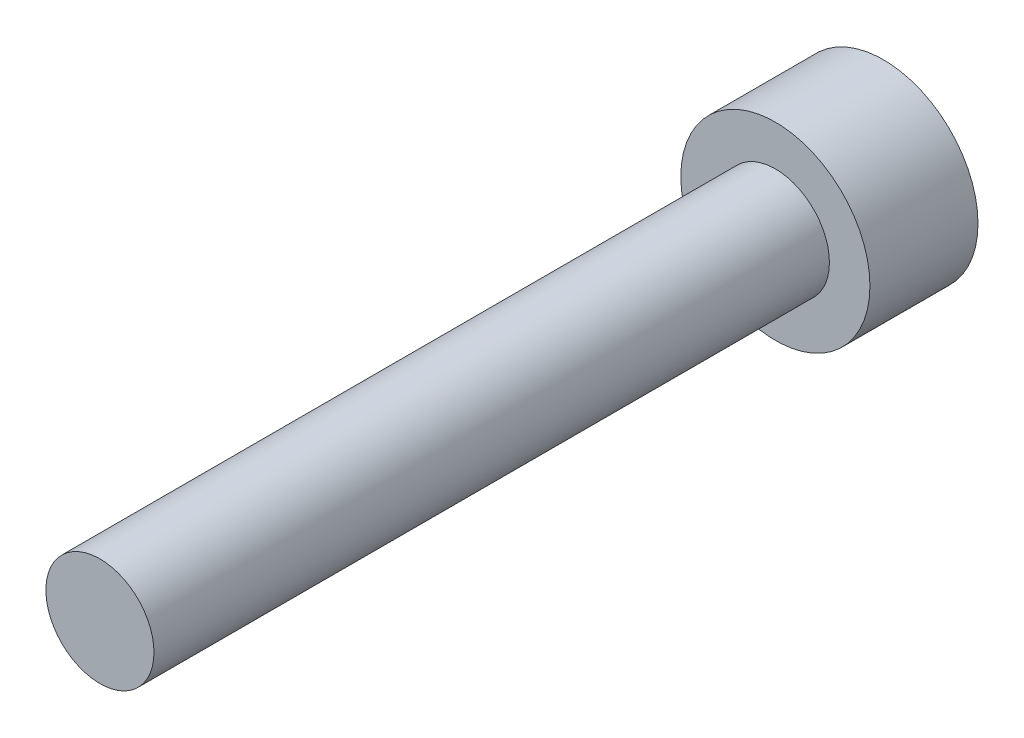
ISO-10303-21;
HEADER;
FILE_DESCRIPTION(('STEP AP214'),'2;1');
FILE_NAME('part.step','',(''),(''),'','','');
FILE_SCHEMA(('AUTOMOTIVE_DESIGN { 1 0 10303 214 1 1 1 1 }'));
ENDSEC;
DATA;
#1=APPLICATION_CONTEXT('core data for automotive mechanical design processes');
#2=APPLICATION_PROTOCOL_DEFINITION('international standard','automotive_design',2000,#1);
#3=PRODUCT_CONTEXT('',#1,'mechanical');
#4=PRODUCT('Part','Part','',(#3));
#5=PRODUCT_RELATED_PRODUCT_CATEGORY('part','',(#4));
#6=PRODUCT_DEFINITION_FORMATION('','',#4);
#7=PRODUCT_DEFINITION_CONTEXT('part definition',#1,'design');
#8=PRODUCT_DEFINITION('design','',#6,#7);
#9=PRODUCT_DEFINITION_SHAPE('','',#8);
#10=(LENGTH_UNIT() NAMED_UNIT(*) SI_UNIT(.MILLI.,.METRE.));
#11=(NAMED_UNIT(*) PLANE_ANGLE_UNIT() SI_UNIT($,.RADIAN.));
#12=(NAMED_UNIT(*) SI_UNIT($,.STERADIAN.) SOLID_ANGLE_UNIT());
#13=UNCERTAINTY_MEASURE_WITH_UNIT(LENGTH_MEASURE(1.E-05),#10,'distance_accuracy_value','');
#14=(GEOMETRIC_REPRESENTATION_CONTEXT(3) GLOBAL_UNCERTAINTY_ASSIGNED_CONTEXT((#13)) GLOBAL_UNIT_ASSIGNED_CONTEXT((#10,
#11,#12)) REPRESENTATION_CONTEXT('',''));
#15=CARTESIAN_POINT('',(0.,0.,0.));
#16=DIRECTION('',(0.,0.,1.));
#17=DIRECTION('',(1.,0.,0.));
#18=AXIS2_PLACEMENT_3D('',#15,#16,#17);
#19=CARTESIAN_POINT('',(0.,0.,25.));
#20=DIRECTION('',(0.,0.,1.));
#21=DIRECTION('',(1.,0.,0.));
#22=AXIS2_PLACEMENT_3D('',#19,#20,#21);
#23=PLANE('',#22);
#24=CARTESIAN_POINT('',(0.,0.,25.));
#25=DIRECTION('',(0.,0.,1.));
#26=DIRECTION('',(1.,0.,0.));
#27=AXIS2_PLACEMENT_3D('',#24,#25,#26);
#28=CIRCLE('',#27,2.);
#29=CARTESIAN_POINT('',(2.,0.,25.));
#30=VERTEX_POINT('',#29);
#31=EDGE_CURVE('E11',#30,#30,#28,.T.);
#32=ORIENTED_EDGE('',*,*,#31,.T.);
#33=EDGE_LOOP('',(#32));
#34=FACE_BOUND('',#33,.T.);
#35=ADVANCED_FACE('F32',(#34),#23,.T.);
#36=CARTESIAN_POINT('',(0.,0.,25.));
#37=DIRECTION('',(0.,0.,1.));
#38=DIRECTION('',(1.,0.,0.));
#39=AXIS2_PLACEMENT_3D('',#36,#37,#38);
#40=CYLINDRICAL_SURFACE('',#39,2.);
#41=CARTESIAN_POINT('',(0.,0.,0.));
#42=DIRECTION('',(0.,0.,1.));
#43=DIRECTION('',(1.,0.,0.));
#44=AXIS2_PLACEMENT_3D('',#41,#42,#43);
#45=CIRCLE('',#44,2.);
#46=CARTESIAN_POINT('',(2.,0.,0.));
#47=VERTEX_POINT('',#46);
#48=EDGE_CURVE('E39',#47,#47,#45,.T.);
#49=ORIENTED_EDGE('',*,*,#48,.T.);
#50=EDGE_LOOP('',(#49));
#51=FACE_BOUND('',#50,.T.);
#52=ORIENTED_EDGE('',*,*,#31,.F.);
#53=EDGE_LOOP('',(#52));
#54=FACE_BOUND('',#53,.T.);
#55=ADVANCED_FACE('F146',(#51,#54),#40,.T.);
#56=CARTESIAN_POINT('',(0.,-2.,0.));
#57=DIRECTION('',(0.,0.,1.));
#58=DIRECTION('',(1.,0.,0.));
#59=AXIS2_PLACEMENT_3D('',#56,#57,#58);
#60=PLANE('',#59);
#61=CARTESIAN_POINT('',(0.,0.,0.));
#62=DIRECTION('',(0.,0.,1.));
#63=DIRECTION('',(1.,0.,0.));
#64=AXIS2_PLACEMENT_3D('',#61,#62,#63);
#65=CIRCLE('',#64,3.5);
#66=CARTESIAN_POINT('',(3.5,0.,0.));
#67=VERTEX_POINT('',#66);
#68=EDGE_CURVE('E141',#67,#67,#65,.T.);
#69=ORIENTED_EDGE('',*,*,#68,.T.);
#70=EDGE_LOOP('',(#69));
#71=FACE_BOUND('',#70,.T.);
#72=ORIENTED_EDGE('',*,*,#48,.F.);
#73=EDGE_LOOP('',(#72));
#74=FACE_BOUND('',#73,.T.);
#75=ADVANCED_FACE('F149',(#71,#74),#60,.T.);
#76=CARTESIAN_POINT('',(0.,0.,25.));
#77=DIRECTION('',(0.,0.,1.));
#78=DIRECTION('',(1.,0.,0.));
#79=AXIS2_PLACEMENT_3D('',#76,#77,#78);
#80=CYLINDRICAL_SURFACE('',#79,3.5);
#81=CARTESIAN_POINT('',(0.,0.,-4.));
#82=DIRECTION('',(0.,0.,1.));
#83=DIRECTION('',(1.,0.,0.));
#84=AXIS2_PLACEMENT_3D('',#81,#82,#83);
#85=CIRCLE('',#84,3.5);
#86=CARTESIAN_POINT('',(3.5,0.,-4.));
#87=VERTEX_POINT('',#86);
#88=EDGE_CURVE('E133',#87,#87,#85,.T.);
#89=ORIENTED_EDGE('',*,*,#88,.T.);
#90=EDGE_LOOP('',(#89));
#91=FACE_BOUND('',#90,.T.);
#92=ORIENTED_EDGE('',*,*,#68,.F.);
#93=EDGE_LOOP('',(#92));
#94=FACE_BOUND('',#93,.T.);
#95=ADVANCED_FACE('F151',(#91,#94),#80,.T.);
#96=CARTESIAN_POINT('',(0.,-3.5,-4.));
#97=DIRECTION('',(0.,0.,-1.));
#98=DIRECTION('',(-1.,0.,0.));
#99=AXIS2_PLACEMENT_3D('',#96,#97,#98);
#100=PLANE('',#99);
#101=DIRECTION('',(0.866025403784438,-0.5,0.));
#102=VECTOR('',#101,1.);
#103=CARTESIAN_POINT('',(0.,1.73205080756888,-4.));
#104=LINE('',#103,#102);
#105=CARTESIAN_POINT('',(0.,1.73205080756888,-4.));
#106=VERTEX_POINT('',#105);
#107=CARTESIAN_POINT('',(1.5,0.866025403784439,-4.));
#108=VERTEX_POINT('',#107);
#109=EDGE_CURVE('E46',#106,#108,#104,.T.);
#110=ORIENTED_EDGE('',*,*,#109,.F.);
#111=DIRECTION('',(0.866025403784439,0.5,0.));
#112=VECTOR('',#111,1.);
#113=CARTESIAN_POINT('',(-1.5,0.866025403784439,-4.));
#114=LINE('',#113,#112);
#115=CARTESIAN_POINT('',(-1.5,0.866025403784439,-4.));
#116=VERTEX_POINT('',#115);
#117=EDGE_CURVE('E129',#116,#106,#114,.T.);
#118=ORIENTED_EDGE('',*,*,#117,.F.);
#119=DIRECTION('',(0.,1.,0.));
#120=VECTOR('',#119,1.);
#121=CARTESIAN_POINT('',(-1.5,-0.866025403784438,-4.));
#122=LINE('',#121,#120);
#123=CARTESIAN_POINT('',(-1.5,-0.866025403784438,-4.));
#124=VERTEX_POINT('',#123);
#125=EDGE_CURVE('E127',#124,#116,#122,.T.);
#126=ORIENTED_EDGE('',*,*,#125,.F.);
#127=DIRECTION('',(-0.866025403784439,0.5,0.));
#128=VECTOR('',#127,1.);
#129=CARTESIAN_POINT('',(0.,-1.73205080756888,-4.));
#130=LINE('',#129,#128);
#131=CARTESIAN_POINT('',(0.,-1.73205080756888,-4.));
#132=VERTEX_POINT('',#131);
#133=EDGE_CURVE('E94',#132,#124,#130,.T.);
#134=ORIENTED_EDGE('',*,*,#133,.F.);
#135=DIRECTION('',(-0.866025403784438,-0.5,0.));
#136=VECTOR('',#135,1.);
#137=CARTESIAN_POINT('',(1.5,-0.866025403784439,-4.));
#138=LINE('',#137,#136);
#139=CARTESIAN_POINT('',(1.5,-0.866025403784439,-4.));
#140=VERTEX_POINT('',#139);
#141=EDGE_CURVE('E123',#140,#132,#138,.T.);
#142=ORIENTED_EDGE('',*,*,#141,.F.);
#143=DIRECTION('',(0.,-1.,0.));
#144=VECTOR('',#143,1.);
#145=CARTESIAN_POINT('',(1.5,0.866025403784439,-4.));
#146=LINE('',#145,#144);
#147=EDGE_CURVE('E120',#108,#140,#146,.T.);
#148=ORIENTED_EDGE('',*,*,#147,.F.);
#149=EDGE_LOOP('',(#110,#118,#126,#134,#142,#148));
#150=FACE_BOUND('',#149,.T.);
#151=ORIENTED_EDGE('',*,*,#88,.F.);
#152=EDGE_LOOP('',(#151));
#153=FACE_BOUND('',#152,.T.);
#154=ADVANCED_FACE('F158',(#150,#153),#100,.T.);
#155=CARTESIAN_POINT('',(0.,1.73205080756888,-1.));
#156=DIRECTION('',(0.5,0.866025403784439,0.));
#157=DIRECTION('',(-0.866025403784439,0.5,0.));
#158=AXIS2_PLACEMENT_3D('',#155,#156,#157);
#159=PLANE('',#158);
#160=ORIENTED_EDGE('',*,*,#109,.T.);
#161=DIRECTION('',(0.,0.,-1.));
#162=VECTOR('',#161,1.);
#163=CARTESIAN_POINT('',(1.5,0.866025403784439,-1.));
#164=LINE('',#163,#162);
#165=CARTESIAN_POINT('',(1.5,0.866025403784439,-1.));
#166=VERTEX_POINT('',#165);
#167=EDGE_CURVE('E76',#166,#108,#164,.T.);
#168=ORIENTED_EDGE('',*,*,#167,.F.);
#169=DIRECTION('',(0.866025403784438,-0.5,0.));
#170=VECTOR('',#169,1.);
#171=CARTESIAN_POINT('',(0.,1.73205080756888,-1.));
#172=LINE('',#171,#170);
#173=CARTESIAN_POINT('',(0.,1.73205080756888,-1.));
#174=VERTEX_POINT('',#173);
#175=EDGE_CURVE('E131',#174,#166,#172,.T.);
#176=ORIENTED_EDGE('',*,*,#175,.F.);
#177=DIRECTION('',(0.,0.,-1.));
#178=VECTOR('',#177,1.);
#179=CARTESIAN_POINT('',(0.,1.73205080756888,-1.));
#180=LINE('',#179,#178);
#181=EDGE_CURVE('E54',#174,#106,#180,.T.);
#182=ORIENTED_EDGE('',*,*,#181,.T.);
#183=EDGE_LOOP('',(#160,#168,#176,#182));
#184=FACE_BOUND('',#183,.T.);
#185=ADVANCED_FACE('F189',(#184),#159,.F.);
#186=CARTESIAN_POINT('',(-1.5,0.866025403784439,-1.));
#187=DIRECTION('',(-0.5,0.866025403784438,0.));
#188=DIRECTION('',(-0.866025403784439,-0.5,0.));
#189=AXIS2_PLACEMENT_3D('',#186,#187,#188);
#190=PLANE('',#189);
#191=ORIENTED_EDGE('',*,*,#117,.T.);
#192=ORIENTED_EDGE('',*,*,#181,.F.);
#193=DIRECTION('',(0.866025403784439,0.5,0.));
#194=VECTOR('',#193,1.);
#195=CARTESIAN_POINT('',(-1.5,0.866025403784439,-1.));
#196=LINE('',#195,#194);
#197=CARTESIAN_POINT('',(-1.5,0.866025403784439,-1.));
#198=VERTEX_POINT('',#197);
#199=EDGE_CURVE('E106',#198,#174,#196,.T.);
#200=ORIENTED_EDGE('',*,*,#199,.F.);
#201=DIRECTION('',(0.,0.,-1.));
#202=VECTOR('',#201,1.);
#203=CARTESIAN_POINT('',(-1.5,0.866025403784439,-1.));
#204=LINE('',#203,#202);
#205=EDGE_CURVE('E98',#198,#116,#204,.T.);
#206=ORIENTED_EDGE('',*,*,#205,.T.);
#207=EDGE_LOOP('',(#191,#192,#200,#206));
#208=FACE_BOUND('',#207,.T.);
#209=ADVANCED_FACE('F199',(#208),#190,.F.);
#210=CARTESIAN_POINT('',(-1.5,-0.866025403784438,-1.));
#211=DIRECTION('',(-1.,0.,0.));
#212=DIRECTION('',(0.,0.,1.));
#213=AXIS2_PLACEMENT_3D('',#210,#211,#212);
#214=PLANE('',#213);
#215=ORIENTED_EDGE('',*,*,#125,.T.);
#216=ORIENTED_EDGE('',*,*,#205,.F.);
#217=DIRECTION('',(0.,1.,0.));
#218=VECTOR('',#217,1.);
#219=CARTESIAN_POINT('',(-1.5,-0.866025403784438,-1.));
#220=LINE('',#219,#218);
#221=CARTESIAN_POINT('',(-1.5,-0.866025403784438,-1.));
#222=VERTEX_POINT('',#221);
#223=EDGE_CURVE('E102',#222,#198,#220,.T.);
#224=ORIENTED_EDGE('',*,*,#223,.F.);
#225=DIRECTION('',(0.,0.,-1.));
#226=VECTOR('',#225,1.);
#227=CARTESIAN_POINT('',(-1.5,-0.866025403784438,-1.));
#228=LINE('',#227,#226);
#229=EDGE_CURVE('E87',#222,#124,#228,.T.);
#230=ORIENTED_EDGE('',*,*,#229,.T.);
#231=EDGE_LOOP('',(#215,#216,#224,#230));
#232=FACE_BOUND('',#231,.T.);
#233=ADVANCED_FACE('F103',(#232),#214,.F.);
#234=CARTESIAN_POINT('',(0.,-1.73205080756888,-1.));
#235=DIRECTION('',(-0.5,-0.866025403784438,0.));
#236=DIRECTION('',(0.866025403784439,-0.5,0.));
#237=AXIS2_PLACEMENT_3D('',#234,#235,#236);
#238=PLANE('',#237);
#239=ORIENTED_EDGE('',*,*,#133,.T.);
#240=ORIENTED_EDGE('',*,*,#229,.F.);
#241=DIRECTION('',(-0.866025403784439,0.5,0.));
#242=VECTOR('',#241,1.);
#243=CARTESIAN_POINT('',(0.,-1.73205080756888,-1.));
#244=LINE('',#243,#242);
#245=CARTESIAN_POINT('',(0.,-1.73205080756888,-1.));
#246=VERTEX_POINT('',#245);
#247=EDGE_CURVE('E91',#246,#222,#244,.T.);
#248=ORIENTED_EDGE('',*,*,#247,.F.);
#249=DIRECTION('',(0.,0.,-1.));
#250=VECTOR('',#249,1.);
#251=CARTESIAN_POINT('',(0.,-1.73205080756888,-1.));
#252=LINE('',#251,#250);
#253=EDGE_CURVE('E99',#246,#132,#252,.T.);
#254=ORIENTED_EDGE('',*,*,#253,.T.);
#255=EDGE_LOOP('',(#239,#240,#248,#254));
#256=FACE_BOUND('',#255,.T.);
#257=ADVANCED_FACE('F89',(#256),#238,.F.);
#258=CARTESIAN_POINT('',(1.5,-0.866025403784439,-1.));
#259=DIRECTION('',(0.5,-0.866025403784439,0.));
#260=DIRECTION('',(0.866025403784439,0.5,0.));
#261=AXIS2_PLACEMENT_3D('',#258,#259,#260);
#262=PLANE('',#261);
#263=ORIENTED_EDGE('',*,*,#141,.T.);
#264=ORIENTED_EDGE('',*,*,#253,.F.);
#265=DIRECTION('',(-0.866025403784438,-0.5,0.));
#266=VECTOR('',#265,1.);
#267=CARTESIAN_POINT('',(1.5,-0.866025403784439,-1.));
#268=LINE('',#267,#266);
#269=CARTESIAN_POINT('',(1.5,-0.866025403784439,-1.));
#270=VERTEX_POINT('',#269);
#271=EDGE_CURVE('E112',#270,#246,#268,.T.);
#272=ORIENTED_EDGE('',*,*,#271,.F.);
#273=DIRECTION('',(0.,0.,-1.));
#274=VECTOR('',#273,1.);
#275=CARTESIAN_POINT('',(1.5,-0.866025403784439,-1.));
#276=LINE('',#275,#274);
#277=EDGE_CURVE('E136',#270,#140,#276,.T.);
#278=ORIENTED_EDGE('',*,*,#277,.T.);
#279=EDGE_LOOP('',(#263,#264,#272,#278));
#280=FACE_BOUND('',#279,.T.);
#281=ADVANCED_FACE('F224',(#280),#262,.F.);
#282=CARTESIAN_POINT('',(1.5,0.866025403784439,-1.));
#283=DIRECTION('',(1.,0.,0.));
#284=DIRECTION('',(0.,0.,-1.));
#285=AXIS2_PLACEMENT_3D('',#282,#283,#284);
#286=PLANE('',#285);
#287=ORIENTED_EDGE('',*,*,#147,.T.);
#288=ORIENTED_EDGE('',*,*,#277,.F.);
#289=DIRECTION('',(0.,-1.,0.));
#290=VECTOR('',#289,1.);
#291=CARTESIAN_POINT('',(1.5,0.866025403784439,-1.));
#292=LINE('',#291,#290);
#293=EDGE_CURVE('E114',#166,#270,#292,.T.);
#294=ORIENTED_EDGE('',*,*,#293,.F.);
#295=ORIENTED_EDGE('',*,*,#167,.T.);
#296=EDGE_LOOP('',(#287,#288,#294,#295));
#297=FACE_BOUND('',#296,.T.);
#298=ADVANCED_FACE('F233',(#297),#286,.F.);
#299=CARTESIAN_POINT('',(3.,0.,-1.));
#300=DIRECTION('',(0.,0.,-1.));
#301=DIRECTION('',(-1.,0.,0.));
#302=AXIS2_PLACEMENT_3D('',#299,#300,#301);
#303=PLANE('',#302);
#304=ORIENTED_EDGE('',*,*,#175,.T.);
#305=ORIENTED_EDGE('',*,*,#293,.T.);
#306=ORIENTED_EDGE('',*,*,#271,.T.);
#307=ORIENTED_EDGE('',*,*,#247,.T.);
#308=ORIENTED_EDGE('',*,*,#223,.T.);
#309=ORIENTED_EDGE('',*,*,#199,.T.);
#310=EDGE_LOOP('',(#304,#305,#306,#307,#308,#309));
#311=FACE_BOUND('',#310,.T.);
#312=ADVANCED_FACE('F109',(#311),#303,.T.);
#313=CLOSED_SHELL('',(#35,#55,#75,#95,#154,#185,#209,#233,#257,#281,#298,#312));
#314=MANIFOLD_SOLID_BREP('B2',#313);
#315=ADVANCED_BREP_SHAPE_REPRESENTATION('',(#18,#314),#14);
#316=SHAPE_DEFINITION_REPRESENTATION(#9,#315);
ENDSEC;
END-ISO-10303-21;
